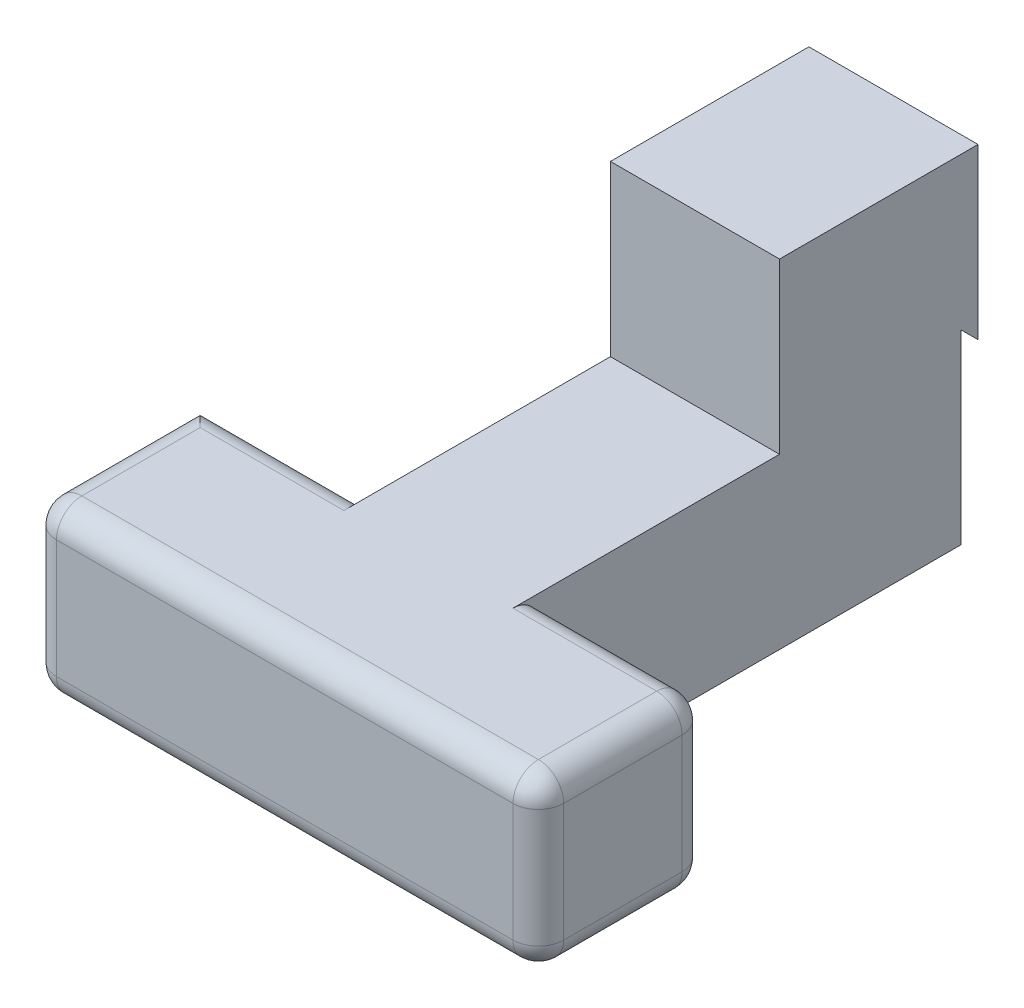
from build123d import *

# Parameters (mm, degrees)
SKETCH1_W           = 20
SKETCH1_H           = 50
BOSS_EXTRUDE1_DEPTH = 10
SKETCH2_W           = 60
SKETCH2_H           = 20
BOSS_EXTRUDE2_DEPTH = 10
SKETCH4_R           = 5
CUT_EXTRUDE1_DEPTH  = 20
SKETCH5_W           = 20
SKETCH5_H           = 23.476022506
BOSS_EXTRUDE3_DEPTH = 20
FILLET2_R           = 3
CUT_EXTRUDE2_DEPTH  = 10


with BuildPart() as part:
    # Sketch1 → Boss-Extrude1 (new, symmetric)
    with BuildSketch(Plane(origin=(0, 0, 0), x_dir=(1, 0, 0), z_dir=(0, 1, 0))):
        Rectangle(SKETCH1_W, SKETCH1_H)
    extrude(amount=BOSS_EXTRUDE1_DEPTH, both=True)

    # Sketch2 → Boss-Extrude2 (add, symmetric)
    with BuildSketch(Plane(origin=(0, 0, 0), x_dir=(1, 0, 0), z_dir=(0, 1, 0))):
        with Locations((0, -35)):
            Rectangle(SKETCH2_W, SKETCH2_H)
    extrude(amount=BOSS_EXTRUDE2_DEPTH, both=True)

    # Sketch4 → Cut-Extrude1 (cut)
    with BuildSketch(Plane(origin=(0, 0, -25), x_dir=(-1, 0, 0), z_dir=(0, 0, -1))):
        Circle(SKETCH4_R)
    extrude(amount=-CUT_EXTRUDE1_DEPTH, mode=Mode.SUBTRACT)

    # Sketch5 → Boss-Extrude3 (add)
    with BuildSketch(Plane(origin=(0, 10, 0), x_dir=(1, 0, 0), z_dir=(0, 1, 0))):
        with Locations((0, 15.261988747)):
            Rectangle(SKETCH5_W, SKETCH5_H)
    extrude(amount=BOSS_EXTRUDE3_DEPTH)

    # Fillet2
    fillet2_edges = [part.edges().sort_by_distance(p)[0] for p in [
        (-20, -10, 25),
        (-30, -10, 35),
        (0, -10, 45),
        (-30, 0, 45),
        (30, -10, 35),
        (30, 0, 45),
        (30, 0, 25),
        (20, -10, 25),
        (-30, 10, 35),
        (0, 10, 45),
        (30, 10, 35),
        (20, 10, 25),
        (-20, 10, 25),
    ]]
    fillet(fillet2_edges, radius=FILLET2_R)

    # Sketch6 → Cut-Extrude2 (cut, symmetric)
    with BuildSketch(Plane(origin=(0, 0, 0), x_dir=(0, 0, -1), z_dir=(1, 0, 0))):
        Polygon((27, 10), (25, 10), (25, 12), align=None)
    extrude(amount=CUT_EXTRUDE2_DEPTH, both=True, mode=Mode.SUBTRACT)


solid = part.part
